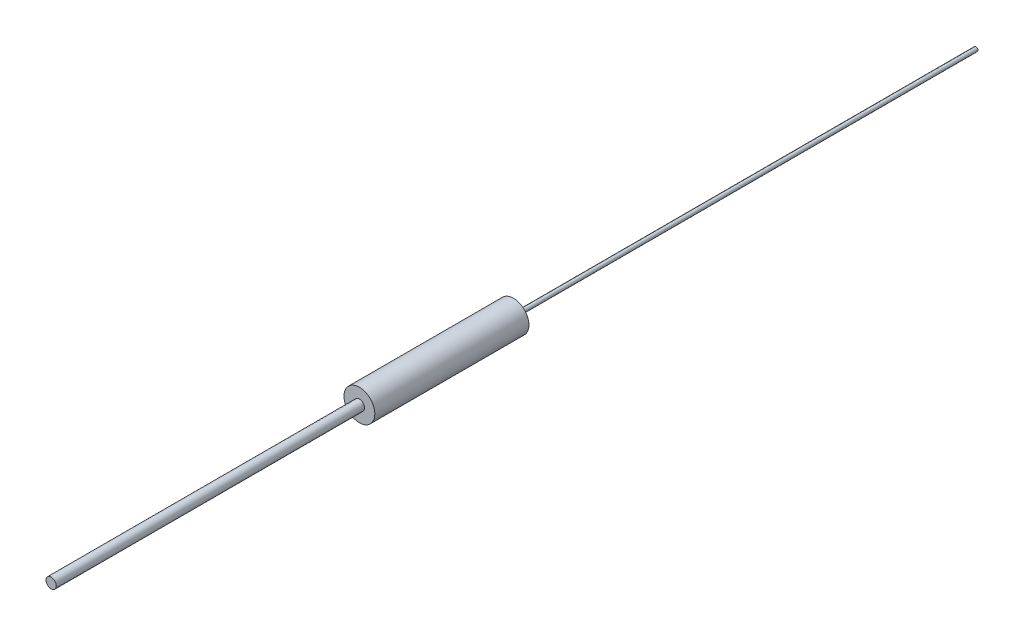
from build123d import *

# Parameters (mm, degrees)
SKETCH_1_R          = 1.5
EXTRUDE_1_DEPTH     = 15
SKETCH_2_R          = 0.2
EXTRUDE_2_DEPTH     = 45
SKETCH_3_R          = 0.5
EXTRUDE_3_DEPTH     = 30
SKETCH_4_R          = 0.1375
SKETCH_4_R_2        = 0.1325
CUT_EXTRUDE_1_DEPTH = 0.1


with BuildPart() as part:
    # Sketch 1 → Extrude 1 (new body)
    with BuildSketch(Plane.XY):
        Circle(SKETCH_1_R)
    extrude(amount=EXTRUDE_1_DEPTH)

    # Sketch 2 → Extrude 2 (add)
    with BuildSketch(Plane(origin=(0, 0, 0), x_dir=(-1, 0, 0), z_dir=(0, 0, -1))):
        with Locations(Location((0, 0, 0), (0, 0, 180))):
            Circle(SKETCH_2_R)
    extrude(amount=EXTRUDE_2_DEPTH)

    # Sketch 3 → Extrude 3 (add)
    with BuildSketch(Plane.XY.offset(15)):
        Circle(SKETCH_3_R)
    extrude(amount=EXTRUDE_3_DEPTH)

    # Sketch 4 → Cut-Extrude 1 (cut)
    with BuildSketch(Plane(origin=(0, 0, -45), x_dir=(-1, 0, 0), z_dir=(0, 0, -1))):
        Circle(SKETCH_4_R)
        Circle(SKETCH_4_R_2, mode=Mode.SUBTRACT)
    extrude(amount=-CUT_EXTRUDE_1_DEPTH, mode=Mode.SUBTRACT)


solid = part.part
